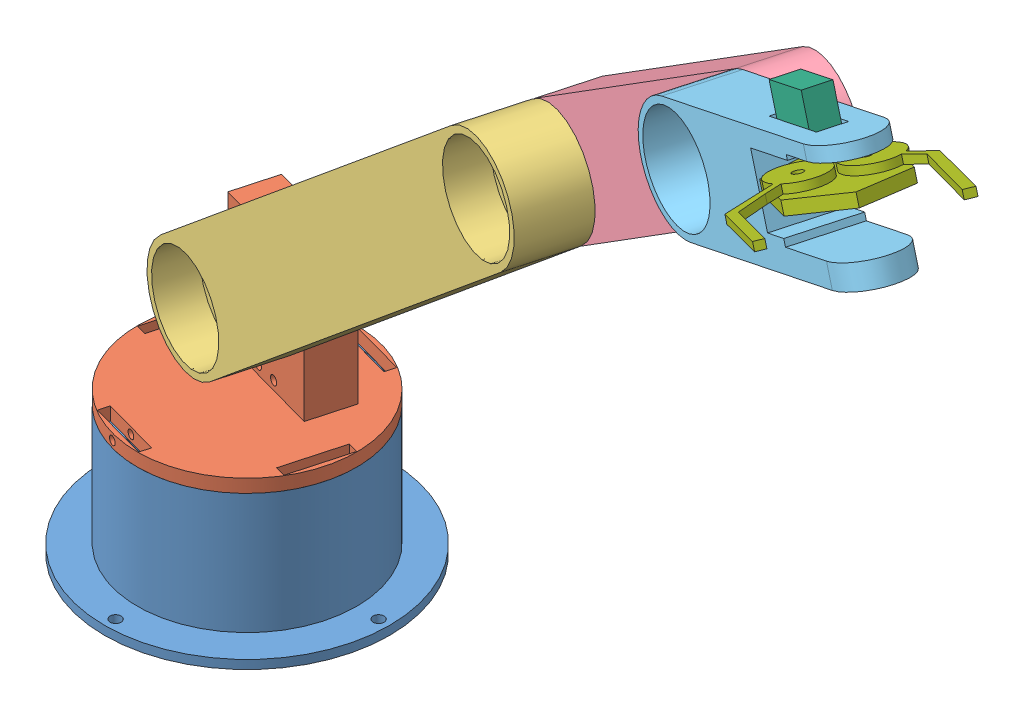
SolidWorks assembly solidwork_assembly.SLDASM, configuration Default (file format 13000). Lengths in mm.
Overall size (527.95 436.96 257.6).
7 component instances, 7 part files, 14 mates.
Components (placement in the parent):
- Base-1: Base.SLDPRT [Default] at (73.1093 -18.6136 155.0078) x (1 0 0) z (0 1 0) size (130 130 59)
- Mancal-1: Mancal.SLDPRT [Default] at (73.1093 46.3864 155.0078) x (-0.963895 0 -0.266283) z (0 1 0) size (100 100.02 66)
- Link1-1: Link1.SLDPRT [Default] at (95.9403 104.5125 154.0528) x (-0.621043 0.764768 -0.171568) z (-0.266283 0 0.963895) size (50 298.72 30)
- Link2-1: Link2.SLDPRT [Default] at (280.8455 262.9158 205.1342) x (0.555065 -0.817551 0.153341) z (0.266283 0 -0.963895) size (50 210 25)
- Link3-2: Link3.SLDPRT [Default] at (384.7181 338.7951 233.8298) x (0.366081 -0.925071 0.101133) z (-0.266283 0 0.963895) size (50 140 30)
- servo_SG90-1: servo_SG90.SLDPRT [Default] at (436.7374 395.5729 263.7932) x (-0.893032 -0.379788 -0.241361) z (0.366081 -0.925071 0.101133) size (31.9 11.8 29.9)
- Gripper-3: Gripper.SLDPRT [Default] at (463.1096 387.0608 275.8694) x (0.481644 0.095363 -0.871163) z (-0.366081 0.925071 -0.101133) size (75.36 95.59 13)
Mates (geometry in assembly coordinates):
- Concentric1: concentric anti-aligned: cylinder of Base-1 through (73.1093 40.3864 155.0078) axis (0 -1 0) radius 41.5; cylinder of Mancal-1 through (73.1093 40.3864 155.0078) axis (0 1 0) radius 50
- Concentric3: concentric anti-aligned: circle of Mancal-1; circle of Link1-1
- Concentric5: concentric aligned: circle of Link1-1; circle of Link2-1
- Concentric7: concentric anti-aligned: circle of Link3-2; circle of servo_SG90-1
- Concentric8: concentric aligned: circle of Link3-2; cylinder of servo_SG90-1 through (450.3264 397.2214 267.4743) axis (0.366081 -0.925071 0.101133) radius 1
- Concentric10: concentric anti-aligned: circle of servo_SG90-1; circle of Gripper-3
- Coincident5: coincident aligned: plane of servo_SG90-1; plane of Gripper-3 through (463.1096 387.0608 275.8694) normal (-0.366081 0.925071 -0.101133)
- Coincident6: coincident anti-aligned: plane of Base-1 through (73.1093 40.3864 155.0078) normal (0 1 0); circle of Mancal-1
- Coincident7: coincident anti-aligned: plane of Mancal-1 through (74.9733 106.3864 148.2605) normal (-0.266283 0 0.963895); plane of Link1-1 through (75.0279 86.2341 148.2756) normal (0.266283 0 -0.963895)
- Coincident8: coincident anti-aligned: plane of Link3-2 through (377.3965 357.2965 231.8072) normal (-0.366081 0.925071 -0.101133); plane of servo_SG90-1 through (440.5629 385.9059 264.85) normal (0.366081 -0.925071 0.101133)
- Coincident10: coincident anti-aligned: plane of Link3-2 through (377.3965 357.2965 231.8072) normal (-0.366081 0.925071 -0.101133); plane of servo_SG90-1 through (440.5629 385.9059 264.85) normal (0.366081 -0.925071 0.101133)
- Coincident14: coincident anti-aligned: plane of Link1-1 through (75.0279 86.2341 148.2756) normal (0.266283 0 -0.963895); plane of Link2-1 through (258.4897 246.5793 198.9583) normal (-0.266283 0 0.963895)
- Concentric11: concentric anti-aligned: circle of Link2-1; circle of Link3-2
- Coincident15: coincident anti-aligned: plane of Link2-1 through (258.4897 246.5793 198.9583) normal (-0.266283 0 0.963895); plane of Link3-2 through (384.6994 338.7871 233.8247) normal (0.266283 0 -0.963895)
